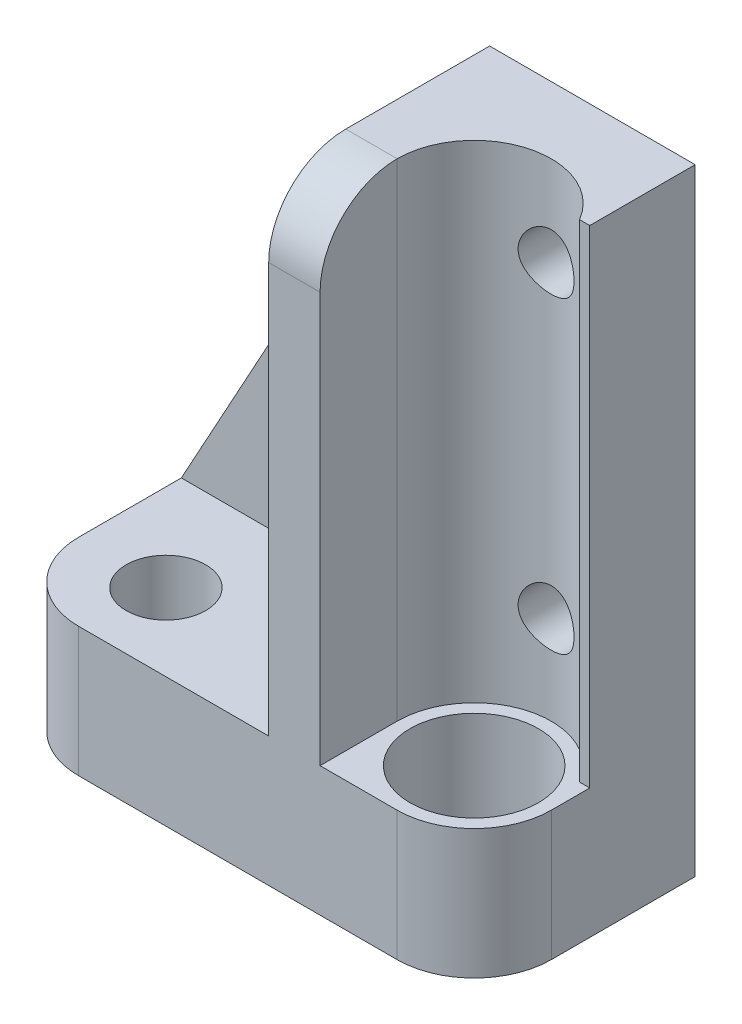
ISO-10303-21;
HEADER;
FILE_DESCRIPTION(('STEP AP214'),'2;1');
FILE_NAME('part.step','',(''),(''),'','','');
FILE_SCHEMA(('AUTOMOTIVE_DESIGN { 1 0 10303 214 1 1 1 1 }'));
ENDSEC;
DATA;
#1=APPLICATION_CONTEXT('core data for automotive mechanical design processes');
#2=APPLICATION_PROTOCOL_DEFINITION('international standard','automotive_design',2000,#1);
#3=PRODUCT_CONTEXT('',#1,'mechanical');
#4=PRODUCT('Part','Part','',(#3));
#5=PRODUCT_RELATED_PRODUCT_CATEGORY('part','',(#4));
#6=PRODUCT_DEFINITION_FORMATION('','',#4);
#7=PRODUCT_DEFINITION_CONTEXT('part definition',#1,'design');
#8=PRODUCT_DEFINITION('design','',#6,#7);
#9=PRODUCT_DEFINITION_SHAPE('','',#8);
#10=(LENGTH_UNIT() NAMED_UNIT(*) SI_UNIT(.MILLI.,.METRE.));
#11=(NAMED_UNIT(*) PLANE_ANGLE_UNIT() SI_UNIT($,.RADIAN.));
#12=(NAMED_UNIT(*) SI_UNIT($,.STERADIAN.) SOLID_ANGLE_UNIT());
#13=UNCERTAINTY_MEASURE_WITH_UNIT(LENGTH_MEASURE(1.E-05),#10,'distance_accuracy_value','');
#14=(GEOMETRIC_REPRESENTATION_CONTEXT(3) GLOBAL_UNCERTAINTY_ASSIGNED_CONTEXT((#13)) GLOBAL_UNIT_ASSIGNED_CONTEXT((#10,
#11,#12)) REPRESENTATION_CONTEXT('',''));
#15=CARTESIAN_POINT('',(0.,0.,0.));
#16=DIRECTION('',(0.,0.,1.));
#17=DIRECTION('',(1.,0.,0.));
#18=AXIS2_PLACEMENT_3D('',#15,#16,#17);
#19=CARTESIAN_POINT('',(-24.4475,8.001,8.89));
#20=DIRECTION('',(1.,0.,0.));
#21=DIRECTION('',(0.,0.,-1.));
#22=AXIS2_PLACEMENT_3D('',#19,#20,#21);
#23=PLANE('',#22);
#24=DIRECTION('',(0.,0.,-1.));
#25=VECTOR('',#24,1.);
#26=CARTESIAN_POINT('',(-24.4475,0.,8.89));
#27=LINE('',#26,#25);
#28=CARTESIAN_POINT('',(-24.4475,0.,0.));
#29=VERTEX_POINT('',#28);
#30=CARTESIAN_POINT('',(-24.4475,0.,-8.89));
#31=VERTEX_POINT('',#30);
#32=EDGE_CURVE('E222',#29,#31,#27,.T.);
#33=ORIENTED_EDGE('',*,*,#32,.F.);
#34=DIRECTION('',(0.,1.,0.));
#35=VECTOR('',#34,1.);
#36=CARTESIAN_POINT('',(-24.4475,8.001,0.));
#37=LINE('',#36,#35);
#38=CARTESIAN_POINT('',(-24.4475,8.001,0.));
#39=VERTEX_POINT('',#38);
#40=EDGE_CURVE('E309',#29,#39,#37,.T.);
#41=ORIENTED_EDGE('',*,*,#40,.T.);
#42=DIRECTION('',(0.,0.,-1.));
#43=VECTOR('',#42,1.);
#44=CARTESIAN_POINT('',(-24.4475,8.001,8.89));
#45=LINE('',#44,#43);
#46=CARTESIAN_POINT('',(-24.4475,8.001,-6.35));
#47=VERTEX_POINT('',#46);
#48=EDGE_CURVE('E213',#39,#47,#45,.T.);
#49=ORIENTED_EDGE('',*,*,#48,.T.);
#50=CARTESIAN_POINT('',(-24.4475,8.001,-8.89));
#51=VERTEX_POINT('',#50);
#52=EDGE_CURVE('E212',#47,#51,#45,.T.);
#53=ORIENTED_EDGE('',*,*,#52,.T.);
#54=DIRECTION('',(0.,-1.,0.));
#55=VECTOR('',#54,1.);
#56=CARTESIAN_POINT('',(-24.4475,8.001,-8.89));
#57=LINE('',#56,#55);
#58=EDGE_CURVE('E190',#51,#31,#57,.T.);
#59=ORIENTED_EDGE('',*,*,#58,.T.);
#60=EDGE_LOOP('',(#33,#41,#49,#53,#59));
#61=FACE_BOUND('',#60,.T.);
#62=ADVANCED_FACE('F37',(#61),#23,.F.);
#63=CARTESIAN_POINT('',(-24.4475,0.,8.89));
#64=DIRECTION('',(0.,1.,0.));
#65=DIRECTION('',(0.,0.,1.));
#66=AXIS2_PLACEMENT_3D('',#63,#64,#65);
#67=PLANE('',#66);
#68=CARTESIAN_POINT('',(-19.05,0.,0.));
#69=DIRECTION('',(0.,1.,0.));
#70=DIRECTION('',(0.,0.,1.));
#71=AXIS2_PLACEMENT_3D('',#68,#69,#70);
#72=CIRCLE('',#71,2.45745);
#73=CARTESIAN_POINT('',(-19.05,0.,2.45745));
#74=VERTEX_POINT('',#73);
#75=EDGE_CURVE('E547',#74,#74,#72,.T.);
#76=ORIENTED_EDGE('',*,*,#75,.T.);
#77=EDGE_LOOP('',(#76));
#78=FACE_BOUND('',#77,.T.);
#79=CARTESIAN_POINT('',(0.,0.,0.));
#80=DIRECTION('',(0.,1.,0.));
#81=DIRECTION('',(0.,0.,1.));
#82=AXIS2_PLACEMENT_3D('',#79,#80,#81);
#83=CIRCLE('',#82,2.45745);
#84=CARTESIAN_POINT('',(0.,0.,2.45745));
#85=VERTEX_POINT('',#84);
#86=EDGE_CURVE('E359',#85,#85,#83,.T.);
#87=ORIENTED_EDGE('',*,*,#86,.T.);
#88=EDGE_LOOP('',(#87));
#89=FACE_BOUND('',#88,.T.);
#90=DIRECTION('',(0.,0.,-1.));
#91=VECTOR('',#90,1.);
#92=CARTESIAN_POINT('',(4.7625,0.,8.89));
#93=LINE('',#92,#91);
#94=CARTESIAN_POINT('',(4.7625,0.,0.));
#95=VERTEX_POINT('',#94);
#96=CARTESIAN_POINT('',(4.7625,0.,-8.89));
#97=VERTEX_POINT('',#96);
#98=EDGE_CURVE('E220',#95,#97,#93,.T.);
#99=ORIENTED_EDGE('',*,*,#98,.F.);
#100=CARTESIAN_POINT('',(0.,0.,0.));
#101=DIRECTION('',(0.,1.,0.));
#102=DIRECTION('',(0.,0.,1.));
#103=AXIS2_PLACEMENT_3D('',#100,#101,#102);
#104=CIRCLE('',#103,4.7625);
#105=CARTESIAN_POINT('',(0.,0.,4.7625));
#106=VERTEX_POINT('',#105);
#107=EDGE_CURVE('E312',#95,#106,#104,.F.);
#108=ORIENTED_EDGE('',*,*,#107,.T.);
#109=DIRECTION('',(-1.,0.,0.));
#110=VECTOR('',#109,1.);
#111=CARTESIAN_POINT('',(-24.4475,0.,4.7625));
#112=LINE('',#111,#110);
#113=CARTESIAN_POINT('',(-19.685,0.,4.7625));
#114=VERTEX_POINT('',#113);
#115=EDGE_CURVE('E155',#106,#114,#112,.T.);
#116=ORIENTED_EDGE('',*,*,#115,.T.);
#117=CARTESIAN_POINT('',(-19.685,0.,0.));
#118=DIRECTION('',(0.,1.,0.));
#119=DIRECTION('',(0.,0.,1.));
#120=AXIS2_PLACEMENT_3D('',#117,#118,#119);
#121=CIRCLE('',#120,4.7625);
#122=EDGE_CURVE('E307',#114,#29,#121,.F.);
#123=ORIENTED_EDGE('',*,*,#122,.T.);
#124=ORIENTED_EDGE('',*,*,#32,.T.);
#125=DIRECTION('',(1.,0.,0.));
#126=VECTOR('',#125,1.);
#127=CARTESIAN_POINT('',(-24.4475,0.,-8.89));
#128=LINE('',#127,#126);
#129=EDGE_CURVE('E201',#31,#97,#128,.T.);
#130=ORIENTED_EDGE('',*,*,#129,.T.);
#131=EDGE_LOOP('',(#99,#108,#116,#123,#124,#130));
#132=FACE_BOUND('',#131,.T.);
#133=ADVANCED_FACE('F279',(#78,#89,#132),#67,.F.);
#134=CARTESIAN_POINT('',(4.7625,0.,8.89));
#135=DIRECTION('',(-1.,0.,0.));
#136=DIRECTION('',(0.,0.,1.));
#137=AXIS2_PLACEMENT_3D('',#134,#135,#136);
#138=PLANE('',#137);
#139=DIRECTION('',(0.,0.,-1.));
#140=VECTOR('',#139,1.);
#141=CARTESIAN_POINT('',(4.7625,8.001,8.89));
#142=LINE('',#141,#140);
#143=CARTESIAN_POINT('',(4.7625,8.001,0.));
#144=VERTEX_POINT('',#143);
#145=CARTESIAN_POINT('',(4.7625,8.001,-2.37595244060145));
#146=VERTEX_POINT('',#145);
#147=EDGE_CURVE('E172',#144,#146,#142,.T.);
#148=ORIENTED_EDGE('',*,*,#147,.F.);
#149=DIRECTION('',(0.,1.,0.));
#150=VECTOR('',#149,1.);
#151=CARTESIAN_POINT('',(4.7625,0.,0.));
#152=LINE('',#151,#150);
#153=EDGE_CURVE('E313',#144,#95,#152,.F.);
#154=ORIENTED_EDGE('',*,*,#153,.T.);
#155=ORIENTED_EDGE('',*,*,#98,.T.);
#156=DIRECTION('',(0.,1.,0.));
#157=VECTOR('',#156,1.);
#158=CARTESIAN_POINT('',(4.7625,0.,-8.89));
#159=LINE('',#158,#157);
#160=CARTESIAN_POINT('',(4.7625,38.1,-8.89));
#161=VERTEX_POINT('',#160);
#162=EDGE_CURVE('E204',#97,#161,#159,.T.);
#163=ORIENTED_EDGE('',*,*,#162,.T.);
#164=DIRECTION('',(0.,0.,-1.));
#165=VECTOR('',#164,1.);
#166=CARTESIAN_POINT('',(4.7625,38.1,8.89));
#167=LINE('',#166,#165);
#168=CARTESIAN_POINT('',(4.7625,38.1,-2.37595244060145));
#169=VERTEX_POINT('',#168);
#170=EDGE_CURVE('E218',#169,#161,#167,.T.);
#171=ORIENTED_EDGE('',*,*,#170,.F.);
#172=DIRECTION('',(0.,1.,0.));
#173=VECTOR('',#172,1.);
#174=CARTESIAN_POINT('',(4.7625,8.001,-2.37595244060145));
#175=LINE('',#174,#173);
#176=EDGE_CURVE('E191',#146,#169,#175,.T.);
#177=ORIENTED_EDGE('',*,*,#176,.F.);
#178=EDGE_LOOP('',(#148,#154,#155,#163,#171,#177));
#179=FACE_BOUND('',#178,.T.);
#180=ADVANCED_FACE('F285',(#179),#138,.F.);
#181=CARTESIAN_POINT('',(4.7625,38.1,8.89));
#182=DIRECTION('',(0.,-1.,0.));
#183=DIRECTION('',(0.,0.,-1.));
#184=AXIS2_PLACEMENT_3D('',#181,#182,#183);
#185=PLANE('',#184);
#186=DIRECTION('',(0.,0.,-1.));
#187=VECTOR('',#186,1.);
#188=CARTESIAN_POINT('',(-7.9375,38.1,8.89));
#189=LINE('',#188,#187);
#190=CARTESIAN_POINT('',(-7.9375,38.1,0.));
#191=VERTEX_POINT('',#190);
#192=CARTESIAN_POINT('',(-7.9375,38.1,-1.5875));
#193=VERTEX_POINT('',#192);
#194=EDGE_CURVE('E216',#191,#193,#189,.T.);
#195=ORIENTED_EDGE('',*,*,#194,.F.);
#196=DIRECTION('',(-1.,0.,0.));
#197=VECTOR('',#196,1.);
#198=CARTESIAN_POINT('',(4.7625,38.1,0.));
#199=LINE('',#198,#197);
#200=CARTESIAN_POINT('',(-4.7625,38.1,0.));
#201=VERTEX_POINT('',#200);
#202=EDGE_CURVE('E345',#191,#201,#199,.F.);
#203=ORIENTED_EDGE('',*,*,#202,.T.);
#204=CARTESIAN_POINT('',(0.,38.1,0.));
#205=DIRECTION('',(0.,1.,0.));
#206=DIRECTION('',(0.,0.,1.));
#207=AXIS2_PLACEMENT_3D('',#204,#205,#206);
#208=CIRCLE('',#207,4.7625);
#209=CARTESIAN_POINT('',(4.1275,38.1,-2.37595244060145));
#210=VERTEX_POINT('',#209);
#211=EDGE_CURVE('E182',#210,#201,#208,.T.);
#212=ORIENTED_EDGE('',*,*,#211,.F.);
#213=DIRECTION('',(-1.,0.,0.));
#214=VECTOR('',#213,1.);
#215=CARTESIAN_POINT('',(4.1275,38.1,-2.37595244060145));
#216=LINE('',#215,#214);
#217=EDGE_CURVE('E176',#169,#210,#216,.T.);
#218=ORIENTED_EDGE('',*,*,#217,.F.);
#219=ORIENTED_EDGE('',*,*,#170,.T.);
#220=DIRECTION('',(-1.,0.,0.));
#221=VECTOR('',#220,1.);
#222=CARTESIAN_POINT('',(4.7625,38.1,-8.89));
#223=LINE('',#222,#221);
#224=CARTESIAN_POINT('',(-7.9375,38.1,-8.89));
#225=VERTEX_POINT('',#224);
#226=EDGE_CURVE('E207',#161,#225,#223,.T.);
#227=ORIENTED_EDGE('',*,*,#226,.T.);
#228=EDGE_CURVE('E52',#193,#225,#189,.T.);
#229=ORIENTED_EDGE('',*,*,#228,.F.);
#230=EDGE_LOOP('',(#195,#203,#212,#218,#219,#227,#229));
#231=FACE_BOUND('',#230,.T.);
#232=ADVANCED_FACE('F370',(#231),#185,.F.);
#233=CARTESIAN_POINT('',(-7.9375,38.1,8.89));
#234=DIRECTION('',(0.876762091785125,-0.480924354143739,0.));
#235=DIRECTION('',(0.480924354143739,0.876762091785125,0.));
#236=AXIS2_PLACEMENT_3D('',#233,#234,#235);
#237=PLANE('',#236);
#238=ORIENTED_EDGE('',*,*,#52,.F.);
#239=DIRECTION('',(0.480924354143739,0.876762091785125,0.));
#240=VECTOR('',#239,1.);
#241=CARTESIAN_POINT('',(-7.9375,38.1,-6.35));
#242=LINE('',#241,#240);
#243=CARTESIAN_POINT('',(-12.7,29.4175961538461,-6.35));
#244=VERTEX_POINT('',#243);
#245=EDGE_CURVE('E166',#47,#244,#242,.T.);
#246=ORIENTED_EDGE('',*,*,#245,.T.);
#247=CARTESIAN_POINT('',(-12.7,29.4175961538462,-1.5875));
#248=DIRECTION('',(0.876762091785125,-0.480924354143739,0.));
#249=DIRECTION('',(-0.480924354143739,-0.876762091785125,0.));
#250=AXIS2_PLACEMENT_3D('',#247,#248,#249);
#251=ELLIPSE('',#250,9.90280479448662,4.7625);
#252=EDGE_CURVE('E11',#244,#193,#251,.T.);
#253=ORIENTED_EDGE('',*,*,#252,.T.);
#254=ORIENTED_EDGE('',*,*,#228,.T.);
#255=DIRECTION('',(-0.480924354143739,-0.876762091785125,0.));
#256=VECTOR('',#255,1.);
#257=CARTESIAN_POINT('',(-7.9375,38.1,-8.89));
#258=LINE('',#257,#256);
#259=EDGE_CURVE('E209',#225,#51,#258,.T.);
#260=ORIENTED_EDGE('',*,*,#259,.T.);
#261=EDGE_LOOP('',(#238,#246,#253,#254,#260));
#262=FACE_BOUND('',#261,.T.);
#263=ADVANCED_FACE('F331',(#262),#237,.F.);
#264=CARTESIAN_POINT('',(0.,0.,-8.89));
#265=DIRECTION('',(0.,0.,1.));
#266=DIRECTION('',(1.,0.,0.));
#267=AXIS2_PLACEMENT_3D('',#264,#265,#266);
#268=PLANE('',#267);
#269=CARTESIAN_POINT('',(0.,32.5755,-8.89));
#270=DIRECTION('',(0.,0.,-1.));
#271=DIRECTION('',(-1.,0.,0.));
#272=AXIS2_PLACEMENT_3D('',#269,#270,#271);
#273=CIRCLE('',#272,1.7272);
#274=CARTESIAN_POINT('',(-1.7272,32.5755,-8.89));
#275=VERTEX_POINT('',#274);
#276=EDGE_CURVE('E538',#275,#275,#273,.T.);
#277=ORIENTED_EDGE('',*,*,#276,.F.);
#278=EDGE_LOOP('',(#277));
#279=FACE_BOUND('',#278,.T.);
#280=CARTESIAN_POINT('',(0.,13.5255,-8.89));
#281=DIRECTION('',(0.,0.,-1.));
#282=DIRECTION('',(-1.,0.,0.));
#283=AXIS2_PLACEMENT_3D('',#280,#281,#282);
#284=CIRCLE('',#283,1.7272);
#285=CARTESIAN_POINT('',(-1.7272,13.5255,-8.89));
#286=VERTEX_POINT('',#285);
#287=EDGE_CURVE('E234',#286,#286,#284,.T.);
#288=ORIENTED_EDGE('',*,*,#287,.F.);
#289=EDGE_LOOP('',(#288));
#290=FACE_BOUND('',#289,.T.);
#291=ORIENTED_EDGE('',*,*,#58,.F.);
#292=ORIENTED_EDGE('',*,*,#259,.F.);
#293=ORIENTED_EDGE('',*,*,#226,.F.);
#294=ORIENTED_EDGE('',*,*,#162,.F.);
#295=ORIENTED_EDGE('',*,*,#129,.F.);
#296=EDGE_LOOP('',(#291,#292,#293,#294,#295));
#297=FACE_BOUND('',#296,.T.);
#298=ADVANCED_FACE('F377',(#279,#290,#297),#268,.F.);
#299=CARTESIAN_POINT('',(-7.9375,8.001,-6.35));
#300=DIRECTION('',(0.,0.,-1.));
#301=DIRECTION('',(-1.,0.,0.));
#302=AXIS2_PLACEMENT_3D('',#299,#300,#301);
#303=PLANE('',#302);
#304=DIRECTION('',(-1.,0.,0.));
#305=VECTOR('',#304,1.);
#306=CARTESIAN_POINT('',(-7.9375,8.001,-6.35));
#307=LINE('',#306,#305);
#308=CARTESIAN_POINT('',(-12.7,8.001,-6.35));
#309=VERTEX_POINT('',#308);
#310=EDGE_CURVE('E194',#309,#47,#307,.T.);
#311=ORIENTED_EDGE('',*,*,#310,.F.);
#312=DIRECTION('',(0.,1.,0.));
#313=VECTOR('',#312,1.);
#314=CARTESIAN_POINT('',(-12.7,38.1,-6.35));
#315=LINE('',#314,#313);
#316=EDGE_CURVE('E45',#309,#244,#315,.T.);
#317=ORIENTED_EDGE('',*,*,#316,.T.);
#318=ORIENTED_EDGE('',*,*,#245,.F.);
#319=EDGE_LOOP('',(#311,#317,#318));
#320=FACE_BOUND('',#319,.T.);
#321=ADVANCED_FACE('F327',(#320),#303,.F.);
#322=CARTESIAN_POINT('',(-7.9375,8.001,-6.35));
#323=DIRECTION('',(1.,0.,0.));
#324=DIRECTION('',(0.,0.,-1.));
#325=AXIS2_PLACEMENT_3D('',#322,#323,#324);
#326=PLANE('',#325);
#327=DIRECTION('',(0.,1.,0.));
#328=VECTOR('',#327,1.);
#329=CARTESIAN_POINT('',(-7.9375,8.001,4.7625));
#330=LINE('',#329,#328);
#331=CARTESIAN_POINT('',(-7.9375,8.001,4.7625));
#332=VERTEX_POINT('',#331);
#333=CARTESIAN_POINT('',(-7.9375,33.3375,4.7625));
#334=VERTEX_POINT('',#333);
#335=EDGE_CURVE('E196',#332,#334,#330,.T.);
#336=ORIENTED_EDGE('',*,*,#335,.T.);
#337=CARTESIAN_POINT('',(-7.9375,33.3375,0.));
#338=DIRECTION('',(1.,0.,0.));
#339=DIRECTION('',(0.,0.,-1.));
#340=AXIS2_PLACEMENT_3D('',#337,#338,#339);
#341=CIRCLE('',#340,4.7625);
#342=EDGE_CURVE('E342',#334,#191,#341,.F.);
#343=ORIENTED_EDGE('',*,*,#342,.T.);
#344=ORIENTED_EDGE('',*,*,#194,.T.);
#345=DIRECTION('',(0.,1.,0.));
#346=VECTOR('',#345,1.);
#347=CARTESIAN_POINT('',(-7.9375,8.001,-1.5875));
#348=LINE('',#347,#346);
#349=CARTESIAN_POINT('',(-7.9375,8.001,-1.5875));
#350=VERTEX_POINT('',#349);
#351=EDGE_CURVE('E340',#193,#350,#348,.F.);
#352=ORIENTED_EDGE('',*,*,#351,.T.);
#353=DIRECTION('',(0.,0.,-1.));
#354=VECTOR('',#353,1.);
#355=CARTESIAN_POINT('',(-7.9375,8.001,-6.35));
#356=LINE('',#355,#354);
#357=EDGE_CURVE('E185',#332,#350,#356,.T.);
#358=ORIENTED_EDGE('',*,*,#357,.F.);
#359=EDGE_LOOP('',(#336,#343,#344,#352,#358));
#360=FACE_BOUND('',#359,.T.);
#361=ADVANCED_FACE('F367',(#360),#326,.F.);
#362=CARTESIAN_POINT('',(0.,8.001,0.));
#363=DIRECTION('',(0.,1.,0.));
#364=DIRECTION('',(0.,0.,1.));
#365=AXIS2_PLACEMENT_3D('',#362,#363,#364);
#366=PLANE('',#365);
#367=CARTESIAN_POINT('',(-19.05,8.001,0.));
#368=DIRECTION('',(0.,1.,0.));
#369=DIRECTION('',(0.,0.,1.));
#370=AXIS2_PLACEMENT_3D('',#367,#368,#369);
#371=CIRCLE('',#370,2.45745);
#372=CARTESIAN_POINT('',(-19.05,8.001,2.45745));
#373=VERTEX_POINT('',#372);
#374=EDGE_CURVE('E233',#373,#373,#371,.T.);
#375=ORIENTED_EDGE('',*,*,#374,.F.);
#376=EDGE_LOOP('',(#375));
#377=FACE_BOUND('',#376,.T.);
#378=ORIENTED_EDGE('',*,*,#48,.F.);
#379=CARTESIAN_POINT('',(-19.685,8.001,0.));
#380=DIRECTION('',(0.,1.,0.));
#381=DIRECTION('',(0.,0.,1.));
#382=AXIS2_PLACEMENT_3D('',#379,#380,#381);
#383=CIRCLE('',#382,4.7625);
#384=CARTESIAN_POINT('',(-19.685,8.001,4.7625));
#385=VERTEX_POINT('',#384);
#386=EDGE_CURVE('E323',#39,#385,#383,.T.);
#387=ORIENTED_EDGE('',*,*,#386,.T.);
#388=DIRECTION('',(-1.,0.,0.));
#389=VECTOR('',#388,1.);
#390=CARTESIAN_POINT('',(0.,8.001,4.7625));
#391=LINE('',#390,#389);
#392=EDGE_CURVE('E154',#332,#385,#391,.T.);
#393=ORIENTED_EDGE('',*,*,#392,.F.);
#394=ORIENTED_EDGE('',*,*,#357,.T.);
#395=CARTESIAN_POINT('',(-12.7,8.001,-1.5875));
#396=DIRECTION('',(0.,1.,0.));
#397=DIRECTION('',(0.,0.,1.));
#398=AXIS2_PLACEMENT_3D('',#395,#396,#397);
#399=CIRCLE('',#398,4.7625);
#400=EDGE_CURVE('E321',#350,#309,#399,.T.);
#401=ORIENTED_EDGE('',*,*,#400,.T.);
#402=ORIENTED_EDGE('',*,*,#310,.T.);
#403=EDGE_LOOP('',(#378,#387,#393,#394,#401,#402));
#404=FACE_BOUND('',#403,.T.);
#405=ADVANCED_FACE('F336',(#377,#404),#366,.T.);
#406=CARTESIAN_POINT('',(0.,8.001,0.));
#407=DIRECTION('',(0.,1.,0.));
#408=DIRECTION('',(0.,0.,1.));
#409=AXIS2_PLACEMENT_3D('',#406,#407,#408);
#410=CYLINDRICAL_SURFACE('',#409,4.7625);
#411=CARTESIAN_POINT('',(-1.7272,32.5755,-4.43826389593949));
#412=CARTESIAN_POINT('',(-1.7272024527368,32.6690250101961,-4.43826170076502));
#413=CARTESIAN_POINT('',(-1.71957825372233,32.7625332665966,-4.44125227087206));
#414=CARTESIAN_POINT('',(-1.68941050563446,32.9467453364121,-4.45281432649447));
#415=CARTESIAN_POINT('',(-1.66686659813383,33.0374490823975,-4.46138594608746));
#416=CARTESIAN_POINT('',(-1.60778321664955,33.2133454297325,-4.48301418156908));
#417=CARTESIAN_POINT('',(-1.57127535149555,33.2985499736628,-4.49606066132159));
#418=CARTESIAN_POINT('',(-1.48541126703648,33.4616567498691,-4.5251527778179));
#419=CARTESIAN_POINT('',(-1.43605147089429,33.5395569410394,-4.54119924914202));
#420=CARTESIAN_POINT('',(-1.32342999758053,33.6894604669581,-4.57531830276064));
#421=CARTESIAN_POINT('',(-1.25966957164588,33.7610762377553,-4.59344781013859));
#422=CARTESIAN_POINT('',(-1.12111687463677,33.8928690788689,-4.6292134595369));
#423=CARTESIAN_POINT('',(-1.04632244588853,33.9530439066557,-4.64684950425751));
#424=CARTESIAN_POINT('',(-0.884916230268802,34.0620799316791,-4.68031233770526));
#425=CARTESIAN_POINT('',(-0.798006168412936,34.1105245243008,-4.6960645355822));
#426=CARTESIAN_POINT('',(-0.616598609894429,34.1919469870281,-4.723304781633));
#427=CARTESIAN_POINT('',(-0.522103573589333,34.2249298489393,-4.73479420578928));
#428=CARTESIAN_POINT('',(-0.332279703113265,34.2731472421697,-4.75181055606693));
#429=CARTESIAN_POINT('',(-0.237140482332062,34.289047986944,-4.75756062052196));
#430=CARTESIAN_POINT('',(-0.0453819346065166,34.3047794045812,-4.7632484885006));
#431=CARTESIAN_POINT('',(0.0512369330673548,34.3046149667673,-4.76318806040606));
#432=CARTESIAN_POINT('',(0.238455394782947,34.288619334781,-4.75740656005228));
#433=CARTESIAN_POINT('',(0.329126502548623,34.2735141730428,-4.7519478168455));
#434=CARTESIAN_POINT('',(0.506546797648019,34.2292807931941,-4.73632258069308));
#435=CARTESIAN_POINT('',(0.593295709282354,34.2001515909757,-4.72615575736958));
#436=CARTESIAN_POINT('',(0.761867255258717,34.1283339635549,-4.70194903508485));
#437=CARTESIAN_POINT('',(0.843602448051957,34.0854588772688,-4.68785619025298));
#438=CARTESIAN_POINT('',(0.998915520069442,33.9875279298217,-4.65723624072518));
#439=CARTESIAN_POINT('',(1.0724908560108,33.9324682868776,-4.64070838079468));
#440=CARTESIAN_POINT('',(1.21368780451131,33.8081826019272,-4.60586004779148));
#441=CARTESIAN_POINT('',(1.28075862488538,33.7383435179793,-4.58749097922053));
#442=CARTESIAN_POINT('',(1.40243506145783,33.5882830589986,-4.55177029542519));
#443=CARTESIAN_POINT('',(1.45703795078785,33.5080594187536,-4.53441890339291));
#444=CARTESIAN_POINT('',(1.55318831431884,33.3374672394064,-4.50240377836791));
#445=CARTESIAN_POINT('',(1.59445924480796,33.2469308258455,-4.48779931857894));
#446=CARTESIAN_POINT('',(1.66096705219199,33.0595253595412,-4.46361535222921));
#447=CARTESIAN_POINT('',(1.68621216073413,32.9626595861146,-4.45403326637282));
#448=CARTESIAN_POINT('',(1.71873956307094,32.7707579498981,-4.44157966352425));
#449=CARTESIAN_POINT('',(1.72689070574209,32.675890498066,-4.43838397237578));
#450=CARTESIAN_POINT('',(1.72749177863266,32.4861101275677,-4.43815063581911));
#451=CARTESIAN_POINT('',(1.71994527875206,32.3911972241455,-4.44111159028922));
#452=CARTESIAN_POINT('',(1.69015114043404,32.208315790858,-4.45253046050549));
#453=CARTESIAN_POINT('',(1.66855346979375,32.1202244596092,-4.46074508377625));
#454=CARTESIAN_POINT('',(1.61207609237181,31.9489488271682,-4.48146351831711));
#455=CARTESIAN_POINT('',(1.5771937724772,31.8657654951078,-4.49396817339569));
#456=CARTESIAN_POINT('',(1.4937258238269,31.7033550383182,-4.52241023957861));
#457=CARTESIAN_POINT('',(1.44469384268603,31.6243765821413,-4.53845462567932));
#458=CARTESIAN_POINT('',(1.33480249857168,31.4754580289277,-4.57198033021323));
#459=CARTESIAN_POINT('',(1.27393905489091,31.4055210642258,-4.58946214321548));
#460=CARTESIAN_POINT('',(1.13788812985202,31.2724245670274,-4.62513115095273));
#461=CARTESIAN_POINT('',(1.06207032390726,31.2099022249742,-4.6432996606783));
#462=CARTESIAN_POINT('',(0.900571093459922,31.0984022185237,-4.6773045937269));
#463=CARTESIAN_POINT('',(0.814889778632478,31.0494244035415,-4.69314104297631));
#464=CARTESIAN_POINT('',(0.636285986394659,30.9667759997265,-4.72066340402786));
#465=CARTESIAN_POINT('',(0.5433991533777,30.9330350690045,-4.73236833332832));
#466=CARTESIAN_POINT('',(0.352750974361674,30.881830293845,-4.75038126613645));
#467=CARTESIAN_POINT('',(0.254991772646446,30.8643593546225,-4.75669162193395));
#468=CARTESIAN_POINT('',(0.0631529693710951,30.8469179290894,-4.76299521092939));
#469=CARTESIAN_POINT('',(-0.0308341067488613,30.8460395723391,-4.76331614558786));
#470=CARTESIAN_POINT('',(-0.217556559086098,30.8595023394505,-4.75844456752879));
#471=CARTESIAN_POINT('',(-0.310292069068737,30.8738418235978,-4.7532526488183));
#472=CARTESIAN_POINT('',(-0.48985343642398,30.9167042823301,-4.73808000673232));
#473=CARTESIAN_POINT('',(-0.576763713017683,30.9449139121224,-4.72820524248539));
#474=CARTESIAN_POINT('',(-0.744633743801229,31.0144112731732,-4.70469111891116));
#475=CARTESIAN_POINT('',(-0.825592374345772,31.0557014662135,-4.69105105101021));
#476=CARTESIAN_POINT('',(-0.982864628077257,31.1521070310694,-4.66069310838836));
#477=CARTESIAN_POINT('',(-1.05885511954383,31.2077166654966,-4.64387256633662));
#478=CARTESIAN_POINT('',(-1.20071184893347,31.3303852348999,-4.6092340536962));
#479=CARTESIAN_POINT('',(-1.26657456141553,31.3974481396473,-4.59141573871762));
#480=CARTESIAN_POINT('',(-1.38958521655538,31.5449969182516,-4.55573955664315));
#481=CARTESIAN_POINT('',(-1.44615494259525,31.6259763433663,-4.53792175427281));
#482=CARTESIAN_POINT('',(-1.5448849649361,31.7968571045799,-4.50526934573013));
#483=CARTESIAN_POINT('',(-1.58704550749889,31.8867582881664,-4.4904346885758));
#484=CARTESIAN_POINT('',(-1.65604477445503,32.0746001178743,-4.46545673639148));
#485=CARTESIAN_POINT('',(-1.68262483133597,32.1726472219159,-4.45539314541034));
#486=CARTESIAN_POINT('',(-1.7181963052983,32.3723041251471,-4.44179970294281));
#487=CARTESIAN_POINT('',(-1.72719733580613,32.4739119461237,-4.43826628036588));
#488=CARTESIAN_POINT('',(-1.7272,32.5755,-4.43826389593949));
#489=B_SPLINE_CURVE_WITH_KNOTS('',3,(#411,#412,#413,#414,#415,#416,#417,#418,#419,#420,#421,
#422,#423,#424,#425,#426,#427,#428,#429,#430,#431,#432,#433,#434,#435,#436,#437,#438,#439,#440,
#441,#442,#443,#444,#445,#446,#447,#448,#449,#450,#451,#452,#453,#454,#455,#456,#457,#458,#459,
#460,#461,#462,#463,#464,#465,#466,#467,#468,#469,#470,#471,#472,#473,#474,#475,#476,#477,#478,
#479,#480,#481,#482,#483,#484,#485,#486,#487,#488),.UNSPECIFIED.,.T.,.F.,(4,2,2,2,2,2,2,2,2,2,2,
2,2,2,2,2,2,2,2,2,2,2,2,2,2,2,2,2,2,2,2,2,2,2,2,2,2,2,4),(0.,0.280197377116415,
0.560401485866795,0.839975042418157,1.11962649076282,1.41107897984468,1.7025885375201,
2.00329061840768,2.30389555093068,2.59229594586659,2.88060856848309,3.15556663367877,
3.43054399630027,3.70942590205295,3.98839448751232,4.28272167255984,4.57711316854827,
4.87726856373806,5.17726965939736,5.46161111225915,5.74588790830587,6.01786922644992,
6.28990407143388,6.5716894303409,6.85357215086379,7.15197079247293,7.45036611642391,
7.7473694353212,8.04424318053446,8.32482325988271,8.60537310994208,8.87985756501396,
9.15439370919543,9.44010280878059,9.72591113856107,10.0255929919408,10.3252697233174,
10.6297902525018,10.9341442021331),.UNSPECIFIED.);
#490=CARTESIAN_POINT('',(-1.7272,32.5755,-4.43826389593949));
#491=VERTEX_POINT('',#490);
#492=EDGE_CURVE('E235',#491,#491,#489,.T.);
#493=ORIENTED_EDGE('',*,*,#492,.T.);
#494=EDGE_LOOP('',(#493));
#495=FACE_BOUND('',#494,.T.);
#496=CARTESIAN_POINT('',(-1.7272,13.5255,-4.43826389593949));
#497=CARTESIAN_POINT('',(-1.7272024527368,13.6190250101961,-4.43826170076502));
#498=CARTESIAN_POINT('',(-1.71957825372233,13.7125332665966,-4.44125227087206));
#499=CARTESIAN_POINT('',(-1.68941050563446,13.8967453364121,-4.45281432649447));
#500=CARTESIAN_POINT('',(-1.66686659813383,13.9874490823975,-4.46138594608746));
#501=CARTESIAN_POINT('',(-1.60778321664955,14.1633454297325,-4.48301418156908));
#502=CARTESIAN_POINT('',(-1.57127535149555,14.2485499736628,-4.49606066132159));
#503=CARTESIAN_POINT('',(-1.48541126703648,14.4116567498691,-4.5251527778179));
#504=CARTESIAN_POINT('',(-1.43605147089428,14.4895569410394,-4.54119924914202));
#505=CARTESIAN_POINT('',(-1.32342999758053,14.6394604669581,-4.57531830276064));
#506=CARTESIAN_POINT('',(-1.25966957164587,14.7110762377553,-4.59344781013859));
#507=CARTESIAN_POINT('',(-1.12111687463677,14.8428690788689,-4.6292134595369));
#508=CARTESIAN_POINT('',(-1.04632244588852,14.9030439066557,-4.64684950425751));
#509=CARTESIAN_POINT('',(-0.884916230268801,15.0120799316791,-4.68031233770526));
#510=CARTESIAN_POINT('',(-0.798006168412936,15.0605245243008,-4.6960645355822));
#511=CARTESIAN_POINT('',(-0.616598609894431,15.1419469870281,-4.723304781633));
#512=CARTESIAN_POINT('',(-0.522103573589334,15.1749298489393,-4.73479420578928));
#513=CARTESIAN_POINT('',(-0.332279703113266,15.2231472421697,-4.75181055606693));
#514=CARTESIAN_POINT('',(-0.237140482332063,15.239047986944,-4.75756062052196));
#515=CARTESIAN_POINT('',(-0.045381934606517,15.2547794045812,-4.7632484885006));
#516=CARTESIAN_POINT('',(0.0512369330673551,15.2546149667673,-4.76318806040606));
#517=CARTESIAN_POINT('',(0.238455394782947,15.238619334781,-4.75740656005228));
#518=CARTESIAN_POINT('',(0.329126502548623,15.2235141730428,-4.7519478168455));
#519=CARTESIAN_POINT('',(0.506546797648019,15.1792807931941,-4.73632258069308));
#520=CARTESIAN_POINT('',(0.593295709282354,15.1501515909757,-4.72615575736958));
#521=CARTESIAN_POINT('',(0.761867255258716,15.0783339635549,-4.70194903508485));
#522=CARTESIAN_POINT('',(0.843602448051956,15.0354588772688,-4.68785619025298));
#523=CARTESIAN_POINT('',(0.998915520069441,14.9375279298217,-4.65723624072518));
#524=CARTESIAN_POINT('',(1.0724908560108,14.8824682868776,-4.64070838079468));
#525=CARTESIAN_POINT('',(1.21368780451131,14.7581826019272,-4.60586004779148));
#526=CARTESIAN_POINT('',(1.28075862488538,14.6883435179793,-4.58749097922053));
#527=CARTESIAN_POINT('',(1.40243506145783,14.5382830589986,-4.55177029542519));
#528=CARTESIAN_POINT('',(1.45703795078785,14.4580594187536,-4.53441890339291));
#529=CARTESIAN_POINT('',(1.55318831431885,14.2874672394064,-4.50240377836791));
#530=CARTESIAN_POINT('',(1.59445924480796,14.1969308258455,-4.48779931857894));
#531=CARTESIAN_POINT('',(1.66096705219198,14.0095253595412,-4.46361535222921));
#532=CARTESIAN_POINT('',(1.68621216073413,13.9126595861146,-4.45403326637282));
#533=CARTESIAN_POINT('',(1.71873956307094,13.7207579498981,-4.44157966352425));
#534=CARTESIAN_POINT('',(1.72689070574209,13.625890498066,-4.43838397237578));
#535=CARTESIAN_POINT('',(1.72749177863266,13.4361101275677,-4.43815063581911));
#536=CARTESIAN_POINT('',(1.71994527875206,13.3411972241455,-4.44111159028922));
#537=CARTESIAN_POINT('',(1.69015114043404,13.1583157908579,-4.45253046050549));
#538=CARTESIAN_POINT('',(1.66855346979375,13.0702244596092,-4.46074508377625));
#539=CARTESIAN_POINT('',(1.61207609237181,12.8989488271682,-4.48146351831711));
#540=CARTESIAN_POINT('',(1.5771937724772,12.8157654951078,-4.49396817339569));
#541=CARTESIAN_POINT('',(1.4937258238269,12.6533550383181,-4.52241023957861));
#542=CARTESIAN_POINT('',(1.44469384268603,12.5743765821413,-4.53845462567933));
#543=CARTESIAN_POINT('',(1.33480249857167,12.4254580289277,-4.57198033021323));
#544=CARTESIAN_POINT('',(1.27393905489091,12.3555210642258,-4.58946214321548));
#545=CARTESIAN_POINT('',(1.13788812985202,12.2224245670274,-4.62513115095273));
#546=CARTESIAN_POINT('',(1.06207032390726,12.1599022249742,-4.6432996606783));
#547=CARTESIAN_POINT('',(0.900571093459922,12.0484022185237,-4.6773045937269));
#548=CARTESIAN_POINT('',(0.814889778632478,11.9994244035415,-4.69314104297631));
#549=CARTESIAN_POINT('',(0.636285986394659,11.9167759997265,-4.72066340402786));
#550=CARTESIAN_POINT('',(0.543399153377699,11.8830350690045,-4.73236833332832));
#551=CARTESIAN_POINT('',(0.352750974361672,11.831830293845,-4.75038126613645));
#552=CARTESIAN_POINT('',(0.254991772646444,11.8143593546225,-4.75669162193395));
#553=CARTESIAN_POINT('',(0.0631529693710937,11.7969179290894,-4.76299521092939));
#554=CARTESIAN_POINT('',(-0.0308341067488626,11.7960395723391,-4.76331614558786));
#555=CARTESIAN_POINT('',(-0.217556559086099,11.8095023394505,-4.75844456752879));
#556=CARTESIAN_POINT('',(-0.310292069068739,11.8238418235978,-4.7532526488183));
#557=CARTESIAN_POINT('',(-0.489853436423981,11.8667042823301,-4.73808000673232));
#558=CARTESIAN_POINT('',(-0.576763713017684,11.8949139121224,-4.72820524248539));
#559=CARTESIAN_POINT('',(-0.74463374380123,11.9644112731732,-4.70469111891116));
#560=CARTESIAN_POINT('',(-0.825592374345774,12.0057014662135,-4.69105105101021));
#561=CARTESIAN_POINT('',(-0.982864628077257,12.1021070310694,-4.66069310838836));
#562=CARTESIAN_POINT('',(-1.05885511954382,12.1577166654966,-4.64387256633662));
#563=CARTESIAN_POINT('',(-1.20071184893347,12.2803852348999,-4.6092340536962));
#564=CARTESIAN_POINT('',(-1.26657456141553,12.3474481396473,-4.59141573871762));
#565=CARTESIAN_POINT('',(-1.38958521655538,12.4949969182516,-4.55573955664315));
#566=CARTESIAN_POINT('',(-1.44615494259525,12.5759763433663,-4.53792175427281));
#567=CARTESIAN_POINT('',(-1.5448849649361,12.7468571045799,-4.50526934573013));
#568=CARTESIAN_POINT('',(-1.58704550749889,12.8367582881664,-4.4904346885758));
#569=CARTESIAN_POINT('',(-1.65604477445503,13.0246001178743,-4.46545673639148));
#570=CARTESIAN_POINT('',(-1.68262483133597,13.1226472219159,-4.45539314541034));
#571=CARTESIAN_POINT('',(-1.7181963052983,13.3223041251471,-4.44179970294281));
#572=CARTESIAN_POINT('',(-1.72719733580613,13.4239119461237,-4.43826628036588));
#573=CARTESIAN_POINT('',(-1.7272,13.5255,-4.43826389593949));
#574=B_SPLINE_CURVE_WITH_KNOTS('',3,(#496,#497,#498,#499,#500,#501,#502,#503,#504,#505,#506,
#507,#508,#509,#510,#511,#512,#513,#514,#515,#516,#517,#518,#519,#520,#521,#522,#523,#524,#525,
#526,#527,#528,#529,#530,#531,#532,#533,#534,#535,#536,#537,#538,#539,#540,#541,#542,#543,#544,
#545,#546,#547,#548,#549,#550,#551,#552,#553,#554,#555,#556,#557,#558,#559,#560,#561,#562,#563,
#564,#565,#566,#567,#568,#569,#570,#571,#572,#573),.UNSPECIFIED.,.T.,.F.,(4,2,2,2,2,2,2,2,2,2,2,
2,2,2,2,2,2,2,2,2,2,2,2,2,2,2,2,2,2,2,2,2,2,2,2,2,2,2,4),(0.,0.280197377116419,
0.560401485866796,0.839975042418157,1.11962649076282,1.41107897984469,1.7025885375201,
2.00329061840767,2.30389555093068,2.59229594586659,2.88060856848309,3.15556663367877,
3.43054399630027,3.70942590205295,3.98839448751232,4.28272167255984,4.57711316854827,
4.87726856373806,5.17726965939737,5.46161111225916,5.74588790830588,6.01786922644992,
6.28990407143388,6.5716894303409,6.85357215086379,7.15197079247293,7.45036611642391,
7.7473694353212,8.04424318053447,8.32482325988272,8.60537310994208,8.87985756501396,
9.15439370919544,9.44010280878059,9.72591113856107,10.0255929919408,10.3252697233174,
10.6297902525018,10.9341442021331),.UNSPECIFIED.);
#575=CARTESIAN_POINT('',(-1.7272,13.5255,-4.43826389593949));
#576=VERTEX_POINT('',#575);
#577=EDGE_CURVE('E226',#576,#576,#574,.T.);
#578=ORIENTED_EDGE('',*,*,#577,.T.);
#579=EDGE_LOOP('',(#578));
#580=FACE_BOUND('',#579,.T.);
#581=ORIENTED_EDGE('',*,*,#211,.T.);
#582=DIRECTION('',(0.,1.,0.));
#583=VECTOR('',#582,1.);
#584=CARTESIAN_POINT('',(-4.7625,8.001,0.));
#585=LINE('',#584,#583);
#586=CARTESIAN_POINT('',(-4.7625,8.001,0.));
#587=VERTEX_POINT('',#586);
#588=EDGE_CURVE('E181',#587,#201,#585,.T.);
#589=ORIENTED_EDGE('',*,*,#588,.F.);
#590=CARTESIAN_POINT('',(0.,8.001,0.));
#591=DIRECTION('',(0.,1.,0.));
#592=DIRECTION('',(0.,0.,1.));
#593=AXIS2_PLACEMENT_3D('',#590,#591,#592);
#594=CIRCLE('',#593,4.7625);
#595=CARTESIAN_POINT('',(4.1275,8.001,-2.37595244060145));
#596=VERTEX_POINT('',#595);
#597=EDGE_CURVE('E171',#596,#587,#594,.T.);
#598=ORIENTED_EDGE('',*,*,#597,.F.);
#599=DIRECTION('',(0.,1.,0.));
#600=VECTOR('',#599,1.);
#601=CARTESIAN_POINT('',(4.1275,8.001,-2.37595244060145));
#602=LINE('',#601,#600);
#603=EDGE_CURVE('E188',#596,#210,#602,.T.);
#604=ORIENTED_EDGE('',*,*,#603,.T.);
#605=EDGE_LOOP('',(#581,#589,#598,#604));
#606=FACE_BOUND('',#605,.T.);
#607=ADVANCED_FACE('F240',(#495,#580,#606),#410,.F.);
#608=CARTESIAN_POINT('',(4.1275,8.001,-2.37595244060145));
#609=DIRECTION('',(0.,0.,-1.));
#610=DIRECTION('',(-1.,0.,0.));
#611=AXIS2_PLACEMENT_3D('',#608,#609,#610);
#612=PLANE('',#611);
#613=ORIENTED_EDGE('',*,*,#217,.T.);
#614=ORIENTED_EDGE('',*,*,#603,.F.);
#615=DIRECTION('',(-1.,0.,0.));
#616=VECTOR('',#615,1.);
#617=CARTESIAN_POINT('',(4.1275,8.001,-2.37595244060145));
#618=LINE('',#617,#616);
#619=EDGE_CURVE('E174',#146,#596,#618,.T.);
#620=ORIENTED_EDGE('',*,*,#619,.F.);
#621=ORIENTED_EDGE('',*,*,#176,.T.);
#622=EDGE_LOOP('',(#613,#614,#620,#621));
#623=FACE_BOUND('',#622,.T.);
#624=ADVANCED_FACE('F272',(#623),#612,.F.);
#625=CARTESIAN_POINT('',(-4.7625,8.001,0.));
#626=DIRECTION('',(-1.,0.,0.));
#627=DIRECTION('',(0.,0.,1.));
#628=AXIS2_PLACEMENT_3D('',#625,#626,#627);
#629=PLANE('',#628);
#630=ORIENTED_EDGE('',*,*,#588,.T.);
#631=CARTESIAN_POINT('',(-4.7625,33.3375,0.));
#632=DIRECTION('',(-1.,0.,0.));
#633=DIRECTION('',(0.,0.,1.));
#634=AXIS2_PLACEMENT_3D('',#631,#632,#633);
#635=CIRCLE('',#634,4.7625);
#636=CARTESIAN_POINT('',(-4.7625,33.3375,4.7625));
#637=VERTEX_POINT('',#636);
#638=EDGE_CURVE('E150',#201,#637,#635,.F.);
#639=ORIENTED_EDGE('',*,*,#638,.T.);
#640=DIRECTION('',(0.,-1.,0.));
#641=VECTOR('',#640,1.);
#642=CARTESIAN_POINT('',(-4.7625,8.001,4.7625));
#643=LINE('',#642,#641);
#644=CARTESIAN_POINT('',(-4.7625,8.001,4.7625));
#645=VERTEX_POINT('',#644);
#646=EDGE_CURVE('E142',#637,#645,#643,.T.);
#647=ORIENTED_EDGE('',*,*,#646,.T.);
#648=DIRECTION('',(0.,0.,1.));
#649=VECTOR('',#648,1.);
#650=CARTESIAN_POINT('',(-4.7625,8.001,0.));
#651=LINE('',#650,#649);
#652=EDGE_CURVE('E147',#587,#645,#651,.T.);
#653=ORIENTED_EDGE('',*,*,#652,.F.);
#654=EDGE_LOOP('',(#630,#639,#647,#653));
#655=FACE_BOUND('',#654,.T.);
#656=ADVANCED_FACE('F145',(#655),#629,.F.);
#657=CARTESIAN_POINT('',(0.,8.001,0.));
#658=DIRECTION('',(0.,1.,0.));
#659=DIRECTION('',(0.,0.,1.));
#660=AXIS2_PLACEMENT_3D('',#657,#658,#659);
#661=PLANE('',#660);
#662=CARTESIAN_POINT('',(0.,8.001,0.));
#663=DIRECTION('',(0.,1.,0.));
#664=DIRECTION('',(0.,0.,1.));
#665=AXIS2_PLACEMENT_3D('',#662,#663,#664);
#666=CIRCLE('',#665,3.96875);
#667=CARTESIAN_POINT('',(0.,8.001,3.96875));
#668=VERTEX_POINT('',#667);
#669=EDGE_CURVE('E550',#668,#668,#666,.T.);
#670=ORIENTED_EDGE('',*,*,#669,.F.);
#671=EDGE_LOOP('',(#670));
#672=FACE_BOUND('',#671,.T.);
#673=DIRECTION('',(-1.,0.,0.));
#674=VECTOR('',#673,1.);
#675=CARTESIAN_POINT('',(0.,8.001,4.7625));
#676=LINE('',#675,#674);
#677=CARTESIAN_POINT('',(0.,8.001,4.7625));
#678=VERTEX_POINT('',#677);
#679=EDGE_CURVE('E159',#678,#645,#676,.T.);
#680=ORIENTED_EDGE('',*,*,#679,.F.);
#681=CARTESIAN_POINT('',(0.,8.001,0.));
#682=DIRECTION('',(0.,1.,0.));
#683=DIRECTION('',(0.,0.,1.));
#684=AXIS2_PLACEMENT_3D('',#681,#682,#683);
#685=CIRCLE('',#684,4.7625);
#686=EDGE_CURVE('E316',#678,#144,#685,.T.);
#687=ORIENTED_EDGE('',*,*,#686,.T.);
#688=ORIENTED_EDGE('',*,*,#147,.T.);
#689=ORIENTED_EDGE('',*,*,#619,.T.);
#690=ORIENTED_EDGE('',*,*,#597,.T.);
#691=ORIENTED_EDGE('',*,*,#652,.T.);
#692=EDGE_LOOP('',(#680,#687,#688,#689,#690,#691));
#693=FACE_BOUND('',#692,.T.);
#694=ADVANCED_FACE('F168',(#672,#693),#661,.T.);
#695=CARTESIAN_POINT('',(-24.4475,0.,4.7625));
#696=DIRECTION('',(0.,0.,-1.));
#697=DIRECTION('',(-1.,0.,0.));
#698=AXIS2_PLACEMENT_3D('',#695,#696,#697);
#699=PLANE('',#698);
#700=ORIENTED_EDGE('',*,*,#646,.F.);
#701=DIRECTION('',(-1.,0.,0.));
#702=VECTOR('',#701,1.);
#703=CARTESIAN_POINT('',(-24.4475,33.3375,4.7625));
#704=LINE('',#703,#702);
#705=EDGE_CURVE('E343',#637,#334,#704,.T.);
#706=ORIENTED_EDGE('',*,*,#705,.T.);
#707=ORIENTED_EDGE('',*,*,#335,.F.);
#708=ORIENTED_EDGE('',*,*,#392,.T.);
#709=DIRECTION('',(0.,1.,0.));
#710=VECTOR('',#709,1.);
#711=CARTESIAN_POINT('',(-19.685,0.,4.7625));
#712=LINE('',#711,#710);
#713=EDGE_CURVE('E165',#385,#114,#712,.F.);
#714=ORIENTED_EDGE('',*,*,#713,.T.);
#715=ORIENTED_EDGE('',*,*,#115,.F.);
#716=DIRECTION('',(0.,1.,0.));
#717=VECTOR('',#716,1.);
#718=CARTESIAN_POINT('',(0.,0.,4.7625));
#719=LINE('',#718,#717);
#720=EDGE_CURVE('E163',#106,#678,#719,.T.);
#721=ORIENTED_EDGE('',*,*,#720,.T.);
#722=ORIENTED_EDGE('',*,*,#679,.T.);
#723=EDGE_LOOP('',(#700,#706,#707,#708,#714,#715,#721,#722));
#724=FACE_BOUND('',#723,.T.);
#725=ADVANCED_FACE('F160',(#724),#699,.F.);
#726=CARTESIAN_POINT('',(0.,8.001,0.));
#727=DIRECTION('',(0.,1.,0.));
#728=DIRECTION('',(0.,0.,1.));
#729=AXIS2_PLACEMENT_3D('',#726,#727,#728);
#730=CYLINDRICAL_SURFACE('',#729,2.45745);
#731=ORIENTED_EDGE('',*,*,#86,.F.);
#732=EDGE_LOOP('',(#731));
#733=FACE_BOUND('',#732,.T.);
#734=CARTESIAN_POINT('',(0.,2.1844,0.));
#735=DIRECTION('',(0.,1.,0.));
#736=DIRECTION('',(0.,0.,1.));
#737=AXIS2_PLACEMENT_3D('',#734,#735,#736);
#738=CIRCLE('',#737,2.45745);
#739=CARTESIAN_POINT('',(0.,2.1844,2.45745));
#740=VERTEX_POINT('',#739);
#741=EDGE_CURVE('E362',#740,#740,#738,.T.);
#742=ORIENTED_EDGE('',*,*,#741,.T.);
#743=EDGE_LOOP('',(#742));
#744=FACE_BOUND('',#743,.T.);
#745=ADVANCED_FACE('F262',(#733,#744),#730,.F.);
#746=CARTESIAN_POINT('',(2.45745,2.1844,0.));
#747=DIRECTION('',(0.,-1.,0.));
#748=DIRECTION('',(0.,0.,-1.));
#749=AXIS2_PLACEMENT_3D('',#746,#747,#748);
#750=PLANE('',#749);
#751=ORIENTED_EDGE('',*,*,#741,.F.);
#752=EDGE_LOOP('',(#751));
#753=FACE_BOUND('',#752,.T.);
#754=CARTESIAN_POINT('',(0.,2.1844,0.));
#755=DIRECTION('',(0.,1.,0.));
#756=DIRECTION('',(0.,0.,1.));
#757=AXIS2_PLACEMENT_3D('',#754,#755,#756);
#758=CIRCLE('',#757,3.96875);
#759=CARTESIAN_POINT('',(0.,2.1844,3.96875));
#760=VERTEX_POINT('',#759);
#761=EDGE_CURVE('E553',#760,#760,#758,.T.);
#762=ORIENTED_EDGE('',*,*,#761,.T.);
#763=EDGE_LOOP('',(#762));
#764=FACE_BOUND('',#763,.T.);
#765=ADVANCED_FACE('F258',(#753,#764),#750,.F.);
#766=CARTESIAN_POINT('',(0.,8.001,0.));
#767=DIRECTION('',(0.,1.,0.));
#768=DIRECTION('',(0.,0.,1.));
#769=AXIS2_PLACEMENT_3D('',#766,#767,#768);
#770=CYLINDRICAL_SURFACE('',#769,3.96875);
#771=ORIENTED_EDGE('',*,*,#761,.F.);
#772=EDGE_LOOP('',(#771));
#773=FACE_BOUND('',#772,.T.);
#774=ORIENTED_EDGE('',*,*,#669,.T.);
#775=EDGE_LOOP('',(#774));
#776=FACE_BOUND('',#775,.T.);
#777=ADVANCED_FACE('F254',(#773,#776),#770,.F.);
#778=CARTESIAN_POINT('',(-19.05,8.001,0.));
#779=DIRECTION('',(0.,1.,0.));
#780=DIRECTION('',(0.,0.,1.));
#781=AXIS2_PLACEMENT_3D('',#778,#779,#780);
#782=CYLINDRICAL_SURFACE('',#781,2.45745);
#783=ORIENTED_EDGE('',*,*,#75,.F.);
#784=EDGE_LOOP('',(#783));
#785=FACE_BOUND('',#784,.T.);
#786=ORIENTED_EDGE('',*,*,#374,.T.);
#787=EDGE_LOOP('',(#786));
#788=FACE_BOUND('',#787,.T.);
#789=ADVANCED_FACE('F249',(#785,#788),#782,.F.);
#790=CARTESIAN_POINT('',(0.,13.5255,-8.89));
#791=DIRECTION('',(0.,0.,-1.));
#792=DIRECTION('',(-1.,0.,0.));
#793=AXIS2_PLACEMENT_3D('',#790,#791,#792);
#794=CYLINDRICAL_SURFACE('',#793,1.7272);
#795=ORIENTED_EDGE('',*,*,#287,.T.);
#796=EDGE_LOOP('',(#795));
#797=FACE_BOUND('',#796,.T.);
#798=ORIENTED_EDGE('',*,*,#577,.F.);
#799=EDGE_LOOP('',(#798));
#800=FACE_BOUND('',#799,.T.);
#801=ADVANCED_FACE('F244',(#797,#800),#794,.F.);
#802=CARTESIAN_POINT('',(0.,32.5755,-8.89));
#803=DIRECTION('',(0.,0.,-1.));
#804=DIRECTION('',(-1.,0.,0.));
#805=AXIS2_PLACEMENT_3D('',#802,#803,#804);
#806=CYLINDRICAL_SURFACE('',#805,1.7272);
#807=ORIENTED_EDGE('',*,*,#276,.T.);
#808=EDGE_LOOP('',(#807));
#809=FACE_BOUND('',#808,.T.);
#810=ORIENTED_EDGE('',*,*,#492,.F.);
#811=EDGE_LOOP('',(#810));
#812=FACE_BOUND('',#811,.T.);
#813=ADVANCED_FACE('F248',(#809,#812),#806,.F.);
#814=CARTESIAN_POINT('',(-24.4475,33.3375,0.));
#815=DIRECTION('',(-1.,0.,0.));
#816=DIRECTION('',(0.,0.,1.));
#817=AXIS2_PLACEMENT_3D('',#814,#815,#816);
#818=CYLINDRICAL_SURFACE('',#817,4.7625);
#819=ORIENTED_EDGE('',*,*,#638,.F.);
#820=ORIENTED_EDGE('',*,*,#202,.F.);
#821=ORIENTED_EDGE('',*,*,#342,.F.);
#822=ORIENTED_EDGE('',*,*,#705,.F.);
#823=EDGE_LOOP('',(#819,#820,#821,#822));
#824=FACE_BOUND('',#823,.T.);
#825=ADVANCED_FACE('F291',(#824),#818,.T.);
#826=CARTESIAN_POINT('',(0.,0.,0.));
#827=DIRECTION('',(0.,1.,0.));
#828=DIRECTION('',(0.,0.,1.));
#829=AXIS2_PLACEMENT_3D('',#826,#827,#828);
#830=CYLINDRICAL_SURFACE('',#829,4.7625);
#831=ORIENTED_EDGE('',*,*,#107,.F.);
#832=ORIENTED_EDGE('',*,*,#153,.F.);
#833=ORIENTED_EDGE('',*,*,#686,.F.);
#834=ORIENTED_EDGE('',*,*,#720,.F.);
#835=EDGE_LOOP('',(#831,#832,#833,#834));
#836=FACE_BOUND('',#835,.T.);
#837=ADVANCED_FACE('F294',(#836),#830,.T.);
#838=CARTESIAN_POINT('',(-19.685,8.001,0.));
#839=DIRECTION('',(0.,1.,0.));
#840=DIRECTION('',(0.,0.,1.));
#841=AXIS2_PLACEMENT_3D('',#838,#839,#840);
#842=CYLINDRICAL_SURFACE('',#841,4.7625);
#843=ORIENTED_EDGE('',*,*,#122,.F.);
#844=ORIENTED_EDGE('',*,*,#713,.F.);
#845=ORIENTED_EDGE('',*,*,#386,.F.);
#846=ORIENTED_EDGE('',*,*,#40,.F.);
#847=EDGE_LOOP('',(#843,#844,#845,#846));
#848=FACE_BOUND('',#847,.T.);
#849=ADVANCED_FACE('F297',(#848),#842,.T.);
#850=CARTESIAN_POINT('',(-12.7,8.001,-1.5875));
#851=DIRECTION('',(0.,-1.,0.));
#852=DIRECTION('',(0.,0.,-1.));
#853=AXIS2_PLACEMENT_3D('',#850,#851,#852);
#854=CYLINDRICAL_SURFACE('',#853,4.7625);
#855=ORIENTED_EDGE('',*,*,#400,.F.);
#856=ORIENTED_EDGE('',*,*,#351,.F.);
#857=ORIENTED_EDGE('',*,*,#252,.F.);
#858=ORIENTED_EDGE('',*,*,#316,.F.);
#859=EDGE_LOOP('',(#855,#856,#857,#858));
#860=FACE_BOUND('',#859,.T.);
#861=ADVANCED_FACE('F39',(#860),#854,.F.);
#862=CLOSED_SHELL('',(#62,#133,#180,#232,#263,#298,#321,#361,#405,#607,#624,#656,#694,#725,#745,
#765,#777,#789,#801,#813,#825,#837,#849,#861));
#863=MANIFOLD_SOLID_BREP('B2',#862);
#864=ADVANCED_BREP_SHAPE_REPRESENTATION('',(#18,#863),#14);
#865=SHAPE_DEFINITION_REPRESENTATION(#9,#864);
ENDSEC;
END-ISO-10303-21;
